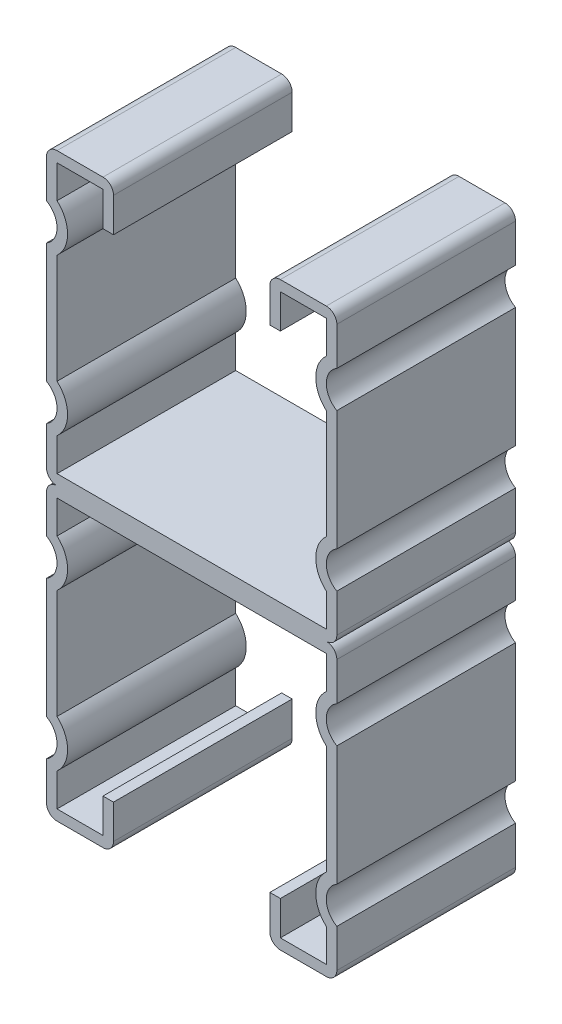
from build123d import *

# Parameters (mm, degrees)
BASE_EXTRUDE_DEPTH = 12.7


with BuildPart() as part:
    # Sketch1 → Base-Extrude (new, symmetric)
    with BuildSketch(Plane.XY):
        with BuildLine():
            Line((-41.275, 39.7764), (-41.275, 34.34565134))
            ThreePointArc((-41.275, 34.34565134), (-39.7764, 31.75), (-41.275, 29.15434866))
            Line((-41.275, 29.15434866), (-41.275, 12.12065134))
            ThreePointArc((-41.275, 12.12065134), (-39.7764, 9.525), (-41.275, 6.92934866))
            Line((-41.275, 6.92934866), (-41.275, 1.4986))
            ThreePointArc((-41.275, 1.4986), (-40.836070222, 0.438929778), (-39.7764, 0))
            Line((-39.7764, 0), (-1.4986, 0))
            ThreePointArc((-1.4986, 0), (-0.438929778, 0.438929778), (0, 1.4986))
            Line((0, 1.4986), (0, 6.92934866))
            ThreePointArc((0, 6.92934866), (-1.4986, 9.525), (0, 12.12065134))
            Line((0, 12.12065134), (0, 29.15434866))
            ThreePointArc((0, 29.15434866), (-1.4986, 31.75), (0, 34.34565134))
            Line((0, 34.34565134), (0, 39.7764))
            ThreePointArc((0, 39.7764), (-0.438929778, 40.836070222), (-1.4986, 41.275))
            Line((-1.4986, 41.275), (-8.0264, 41.275))
            ThreePointArc((-8.0264, 41.275), (-9.086070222, 40.836070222), (-9.525, 39.7764))
            Line((-9.525, 39.7764), (-9.525, 34.925))
            Line((-9.525, 34.925), (-8.0264, 34.925))
            Line((-8.0264, 34.925), (-8.0264, 39.7764))
            Line((-8.0264, 39.7764), (-1.4986, 39.7764))
            Line((-1.4986, 39.7764), (-1.4986, 35.100971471))
            ThreePointArc((-1.4986, 35.100971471), (-2.9972, 31.75), (-1.4986, 28.399028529))
            Line((-1.4986, 28.399028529), (-1.4986, 12.875971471))
            ThreePointArc((-1.4986, 12.875971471), (-2.9972, 9.525), (-1.4986, 6.174028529))
            Line((-1.4986, 6.174028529), (-1.4986, 1.4986))
            Line((-1.4986, 1.4986), (-39.7764, 1.4986))
            Line((-39.7764, 1.4986), (-39.7764, 6.174028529))
            ThreePointArc((-39.7764, 6.174028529), (-38.2778, 9.525), (-39.7764, 12.875971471))
            Line((-39.7764, 12.875971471), (-39.7764, 28.399028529))
            ThreePointArc((-39.7764, 28.399028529), (-38.2778, 31.75), (-39.7764, 35.100971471))
            Line((-39.7764, 35.100971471), (-39.7764, 39.7764))
            Line((-39.7764, 39.7764), (-33.2486, 39.7764))
            Line((-33.2486, 39.7764), (-33.2486, 34.925))
            Line((-33.2486, 34.925), (-31.75, 34.925))
            Line((-31.75, 34.925), (-31.75, 39.7764))
            ThreePointArc((-31.75, 39.7764), (-32.188929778, 40.836070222), (-33.2486, 41.275))
            Line((-33.2486, 41.275), (-39.7764, 41.275))
            ThreePointArc((-39.7764, 41.275), (-40.836070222, 40.836070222), (-41.275, 39.7764))
        make_face()
    base_extrude = extrude(amount=BASE_EXTRUDE_DEPTH, both=True)

    # Mirror1: Base-Extrude across plane
    add(base_extrude.mirror(Plane.ZX))


solid = part.part
